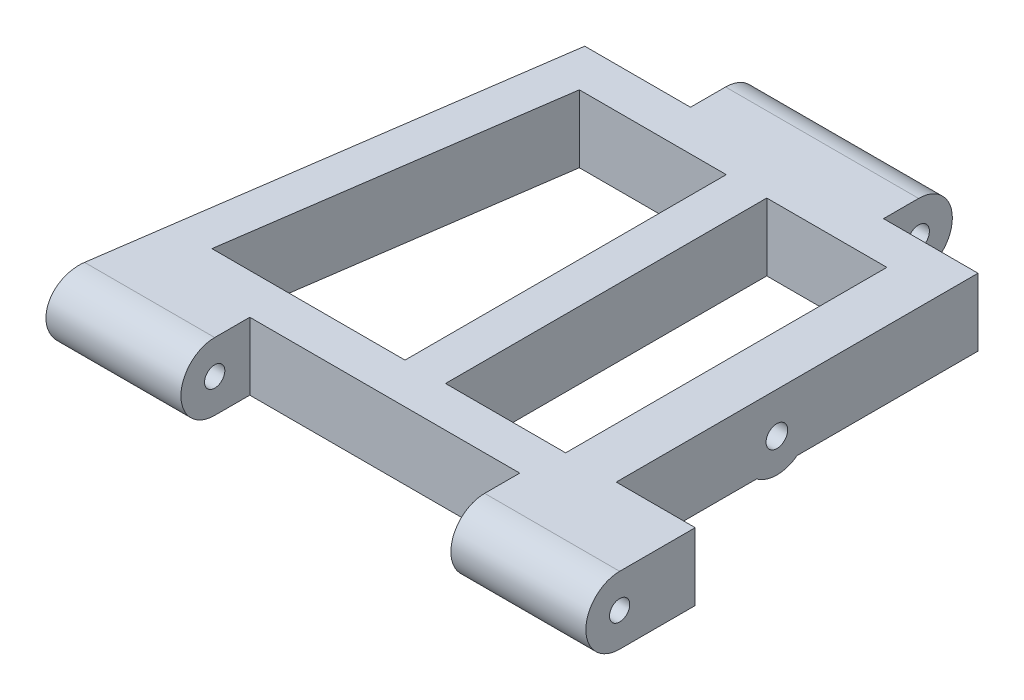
ISO-10303-21;
HEADER;
FILE_DESCRIPTION(('STEP AP214'),'2;1');
FILE_NAME('part.step','',(''),(''),'','','');
FILE_SCHEMA(('AUTOMOTIVE_DESIGN { 1 0 10303 214 1 1 1 1 }'));
ENDSEC;
DATA;
#1=APPLICATION_CONTEXT('core data for automotive mechanical design processes');
#2=APPLICATION_PROTOCOL_DEFINITION('international standard','automotive_design',2000,#1);
#3=PRODUCT_CONTEXT('',#1,'mechanical');
#4=PRODUCT('Part','Part','',(#3));
#5=PRODUCT_RELATED_PRODUCT_CATEGORY('part','',(#4));
#6=PRODUCT_DEFINITION_FORMATION('','',#4);
#7=PRODUCT_DEFINITION_CONTEXT('part definition',#1,'design');
#8=PRODUCT_DEFINITION('design','',#6,#7);
#9=PRODUCT_DEFINITION_SHAPE('','',#8);
#10=(LENGTH_UNIT() NAMED_UNIT(*) SI_UNIT(.MILLI.,.METRE.));
#11=(NAMED_UNIT(*) PLANE_ANGLE_UNIT() SI_UNIT($,.RADIAN.));
#12=(NAMED_UNIT(*) SI_UNIT($,.STERADIAN.) SOLID_ANGLE_UNIT());
#13=UNCERTAINTY_MEASURE_WITH_UNIT(LENGTH_MEASURE(1.E-05),#10,'distance_accuracy_value','');
#14=(GEOMETRIC_REPRESENTATION_CONTEXT(3) GLOBAL_UNCERTAINTY_ASSIGNED_CONTEXT((#13)) GLOBAL_UNIT_ASSIGNED_CONTEXT((#10,
#11,#12)) REPRESENTATION_CONTEXT('',''));
#15=CARTESIAN_POINT('',(0.,0.,0.));
#16=DIRECTION('',(0.,0.,1.));
#17=DIRECTION('',(1.,0.,0.));
#18=AXIS2_PLACEMENT_3D('',#15,#16,#17);
#19=CARTESIAN_POINT('',(-140.419266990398,10.,-20.1852696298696));
#20=DIRECTION('',(0.98982538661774,0.,0.1422873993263));
#21=DIRECTION('',(0.1422873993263,0.,-0.98982538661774));
#22=AXIS2_PLACEMENT_3D('',#19,#20,#21);
#23=PLANE('',#22);
#24=CARTESIAN_POINT('',(-138.818771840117,5.,-31.3191489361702));
#25=DIRECTION('',(0.98982538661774,0.,0.1422873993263));
#26=DIRECTION('',(-0.1422873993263,0.,0.98982538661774));
#27=AXIS2_PLACEMENT_3D('',#24,#25,#26);
#28=ELLIPSE('',#27,1.51541880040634,1.5);
#29=CARTESIAN_POINT('',(-139.034396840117,5.,-29.8191489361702));
#30=VERTEX_POINT('',#29);
#31=EDGE_CURVE('E372',#30,#30,#28,.T.);
#32=ORIENTED_EDGE('',*,*,#31,.T.);
#33=EDGE_LOOP('',(#32));
#34=FACE_BOUND('',#33,.T.);
#35=DIRECTION('',(-0.1422873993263,0.,0.98982538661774));
#36=VECTOR('',#35,1.);
#37=CARTESIAN_POINT('',(-140.419266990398,0.,-20.1852696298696));
#38=LINE('',#37,#36);
#39=CARTESIAN_POINT('',(-129.503771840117,0.,-96.1191489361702));
#40=VERTEX_POINT('',#39);
#41=CARTESIAN_POINT('',(-138.818771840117,0.,-31.3191489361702));
#42=VERTEX_POINT('',#41);
#43=EDGE_CURVE('E467',#40,#42,#38,.T.);
#44=ORIENTED_EDGE('',*,*,#43,.T.);
#45=CARTESIAN_POINT('',(-138.818771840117,5.,-31.3191489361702));
#46=DIRECTION('',(0.98982538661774,0.,0.1422873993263));
#47=DIRECTION('',(-0.1422873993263,0.,0.98982538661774));
#48=AXIS2_PLACEMENT_3D('',#45,#46,#47);
#49=ELLIPSE('',#48,5.05139600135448,5.);
#50=CARTESIAN_POINT('',(-138.818771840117,10.,-31.3191489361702));
#51=VERTEX_POINT('',#50);
#52=EDGE_CURVE('E379',#51,#42,#49,.T.);
#53=ORIENTED_EDGE('',*,*,#52,.F.);
#54=DIRECTION('',(-0.1422873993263,0.,0.98982538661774));
#55=VECTOR('',#54,1.);
#56=CARTESIAN_POINT('',(-140.419266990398,10.,-20.1852696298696));
#57=LINE('',#56,#55);
#58=CARTESIAN_POINT('',(-129.503771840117,10.,-96.1191489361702));
#59=VERTEX_POINT('',#58);
#60=EDGE_CURVE('E419',#59,#51,#57,.T.);
#61=ORIENTED_EDGE('',*,*,#60,.F.);
#62=DIRECTION('',(0.,-1.,0.));
#63=VECTOR('',#62,1.);
#64=CARTESIAN_POINT('',(-129.503771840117,10.,-96.1191489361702));
#65=LINE('',#64,#63);
#66=EDGE_CURVE('E510',#59,#40,#65,.T.);
#67=ORIENTED_EDGE('',*,*,#66,.T.);
#68=EDGE_LOOP('',(#44,#53,#61,#67));
#69=FACE_BOUND('',#68,.T.);
#70=ADVANCED_FACE('F162',(#34,#69),#23,.F.);
#71=CARTESIAN_POINT('',(-119.537521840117,10.,3.25277718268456E-13));
#72=DIRECTION('',(1.,0.,0.));
#73=DIRECTION('',(0.,0.,-1.));
#74=AXIS2_PLACEMENT_3D('',#71,#72,#73);
#75=PLANE('',#74);
#76=CARTESIAN_POINT('',(-119.537521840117,5.,-31.3191489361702));
#77=DIRECTION('',(1.,0.,0.));
#78=DIRECTION('',(0.,0.,-1.));
#79=AXIS2_PLACEMENT_3D('',#76,#77,#78);
#80=CIRCLE('',#79,1.5);
#81=CARTESIAN_POINT('',(-119.537521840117,5.,-32.8191489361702));
#82=VERTEX_POINT('',#81);
#83=EDGE_CURVE('E369',#82,#82,#80,.T.);
#84=ORIENTED_EDGE('',*,*,#83,.F.);
#85=EDGE_LOOP('',(#84));
#86=FACE_BOUND('',#85,.T.);
#87=CARTESIAN_POINT('',(-119.537521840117,5.,-31.3191489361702));
#88=DIRECTION('',(1.,0.,0.));
#89=DIRECTION('',(0.,0.,-1.));
#90=AXIS2_PLACEMENT_3D('',#87,#88,#89);
#91=CIRCLE('',#90,5.);
#92=CARTESIAN_POINT('',(-119.537521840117,10.,-31.3191489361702));
#93=VERTEX_POINT('',#92);
#94=CARTESIAN_POINT('',(-119.537521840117,0.,-31.3191489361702));
#95=VERTEX_POINT('',#94);
#96=EDGE_CURVE('E377',#93,#95,#91,.T.);
#97=ORIENTED_EDGE('',*,*,#96,.T.);
#98=DIRECTION('',(0.,0.,1.));
#99=VECTOR('',#98,1.);
#100=CARTESIAN_POINT('',(-119.537521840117,0.,3.25277718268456E-13));
#101=LINE('',#100,#99);
#102=CARTESIAN_POINT('',(-119.537521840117,0.,-36.5191489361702));
#103=VERTEX_POINT('',#102);
#104=EDGE_CURVE('E470',#103,#95,#101,.T.);
#105=ORIENTED_EDGE('',*,*,#104,.F.);
#106=DIRECTION('',(0.,-1.,0.));
#107=VECTOR('',#106,1.);
#108=CARTESIAN_POINT('',(-119.537521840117,10.,-36.5191489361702));
#109=LINE('',#108,#107);
#110=CARTESIAN_POINT('',(-119.537521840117,10.,-36.5191489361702));
#111=VERTEX_POINT('',#110);
#112=EDGE_CURVE('E508',#111,#103,#109,.T.);
#113=ORIENTED_EDGE('',*,*,#112,.F.);
#114=DIRECTION('',(0.,0.,1.));
#115=VECTOR('',#114,1.);
#116=CARTESIAN_POINT('',(-119.537521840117,10.,3.25277718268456E-13));
#117=LINE('',#116,#115);
#118=EDGE_CURVE('E422',#111,#93,#117,.T.);
#119=ORIENTED_EDGE('',*,*,#118,.T.);
#120=EDGE_LOOP('',(#97,#105,#113,#119));
#121=FACE_BOUND('',#120,.T.);
#122=ADVANCED_FACE('F590',(#86,#121),#75,.T.);
#123=CARTESIAN_POINT('',(-79.5375218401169,10.,0.));
#124=DIRECTION('',(1.,0.,0.));
#125=DIRECTION('',(0.,0.,-1.));
#126=AXIS2_PLACEMENT_3D('',#123,#124,#125);
#127=PLANE('',#126);
#128=CARTESIAN_POINT('',(-79.5375218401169,5.,-31.3191489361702));
#129=DIRECTION('',(1.,0.,0.));
#130=DIRECTION('',(0.,0.,-1.));
#131=AXIS2_PLACEMENT_3D('',#128,#129,#130);
#132=CIRCLE('',#131,1.5);
#133=CARTESIAN_POINT('',(-79.5375218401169,5.,-32.8191489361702));
#134=VERTEX_POINT('',#133);
#135=EDGE_CURVE('E366',#134,#134,#132,.T.);
#136=ORIENTED_EDGE('',*,*,#135,.T.);
#137=EDGE_LOOP('',(#136));
#138=FACE_BOUND('',#137,.T.);
#139=DIRECTION('',(0.,0.,1.));
#140=VECTOR('',#139,1.);
#141=CARTESIAN_POINT('',(-79.5375218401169,0.,0.));
#142=LINE('',#141,#140);
#143=CARTESIAN_POINT('',(-79.5375218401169,0.,-36.5191489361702));
#144=VERTEX_POINT('',#143);
#145=CARTESIAN_POINT('',(-79.5375218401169,0.,-31.3191489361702));
#146=VERTEX_POINT('',#145);
#147=EDGE_CURVE('E476',#144,#146,#142,.T.);
#148=ORIENTED_EDGE('',*,*,#147,.T.);
#149=CARTESIAN_POINT('',(-79.5375218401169,5.,-31.3191489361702));
#150=DIRECTION('',(1.,0.,0.));
#151=DIRECTION('',(0.,0.,-1.));
#152=AXIS2_PLACEMENT_3D('',#149,#150,#151);
#153=CIRCLE('',#152,5.);
#154=CARTESIAN_POINT('',(-79.5375218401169,10.,-31.3191489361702));
#155=VERTEX_POINT('',#154);
#156=EDGE_CURVE('E375',#155,#146,#153,.T.);
#157=ORIENTED_EDGE('',*,*,#156,.F.);
#158=DIRECTION('',(0.,0.,1.));
#159=VECTOR('',#158,1.);
#160=CARTESIAN_POINT('',(-79.5375218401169,10.,0.));
#161=LINE('',#160,#159);
#162=CARTESIAN_POINT('',(-79.5375218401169,10.,-36.5191489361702));
#163=VERTEX_POINT('',#162);
#164=EDGE_CURVE('E428',#163,#155,#161,.T.);
#165=ORIENTED_EDGE('',*,*,#164,.F.);
#166=DIRECTION('',(0.,-1.,0.));
#167=VECTOR('',#166,1.);
#168=CARTESIAN_POINT('',(-79.5375218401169,10.,-36.5191489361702));
#169=LINE('',#168,#167);
#170=EDGE_CURVE('E505',#163,#144,#169,.T.);
#171=ORIENTED_EDGE('',*,*,#170,.T.);
#172=EDGE_LOOP('',(#148,#157,#165,#171));
#173=FACE_BOUND('',#172,.T.);
#174=ADVANCED_FACE('F596',(#138,#173),#127,.F.);
#175=CARTESIAN_POINT('',(-59.5375218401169,10.,0.));
#176=DIRECTION('',(1.,0.,0.));
#177=DIRECTION('',(0.,0.,-1.));
#178=AXIS2_PLACEMENT_3D('',#175,#176,#177);
#179=PLANE('',#178);
#180=CARTESIAN_POINT('',(-59.5375218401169,5.,-31.3191489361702));
#181=DIRECTION('',(-1.,0.,0.));
#182=DIRECTION('',(0.,0.,1.));
#183=AXIS2_PLACEMENT_3D('',#180,#181,#182);
#184=CIRCLE('',#183,1.5);
#185=CARTESIAN_POINT('',(-59.5375218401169,5.,-29.8191489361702));
#186=VERTEX_POINT('',#185);
#187=EDGE_CURVE('E363',#186,#186,#184,.T.);
#188=ORIENTED_EDGE('',*,*,#187,.T.);
#189=EDGE_LOOP('',(#188));
#190=FACE_BOUND('',#189,.T.);
#191=CARTESIAN_POINT('',(-59.5375218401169,5.,-31.3191489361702));
#192=DIRECTION('',(-1.,0.,0.));
#193=DIRECTION('',(0.,0.,1.));
#194=AXIS2_PLACEMENT_3D('',#191,#192,#193);
#195=CIRCLE('',#194,5.);
#196=CARTESIAN_POINT('',(-59.5375218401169,0.,-31.3191489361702));
#197=VERTEX_POINT('',#196);
#198=CARTESIAN_POINT('',(-59.5375218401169,10.,-31.3191489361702));
#199=VERTEX_POINT('',#198);
#200=EDGE_CURVE('E357',#197,#199,#195,.T.);
#201=ORIENTED_EDGE('',*,*,#200,.F.);
#202=DIRECTION('',(0.,0.,1.));
#203=VECTOR('',#202,1.);
#204=CARTESIAN_POINT('',(-59.5375218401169,0.,0.));
#205=LINE('',#204,#203);
#206=CARTESIAN_POINT('',(-59.5375218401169,0.,-42.5191489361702));
#207=VERTEX_POINT('',#206);
#208=EDGE_CURVE('E479',#207,#197,#205,.T.);
#209=ORIENTED_EDGE('',*,*,#208,.F.);
#210=DIRECTION('',(0.,-1.,0.));
#211=VECTOR('',#210,1.);
#212=CARTESIAN_POINT('',(-59.5375218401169,10.,-42.5191489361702));
#213=LINE('',#212,#211);
#214=CARTESIAN_POINT('',(-59.5375218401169,10.,-42.5191489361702));
#215=VERTEX_POINT('',#214);
#216=EDGE_CURVE('E503',#215,#207,#213,.T.);
#217=ORIENTED_EDGE('',*,*,#216,.F.);
#218=DIRECTION('',(0.,0.,1.));
#219=VECTOR('',#218,1.);
#220=CARTESIAN_POINT('',(-59.5375218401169,10.,0.));
#221=LINE('',#220,#219);
#222=EDGE_CURVE('E431',#215,#199,#221,.T.);
#223=ORIENTED_EDGE('',*,*,#222,.T.);
#224=EDGE_LOOP('',(#201,#209,#217,#223));
#225=FACE_BOUND('',#224,.T.);
#226=ADVANCED_FACE('F604',(#190,#225),#179,.T.);
#227=CARTESIAN_POINT('',(-85.2375218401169,10.,0.));
#228=DIRECTION('',(1.,0.,0.));
#229=DIRECTION('',(0.,0.,-1.));
#230=AXIS2_PLACEMENT_3D('',#227,#228,#229);
#231=PLANE('',#230);
#232=CARTESIAN_POINT('',(-85.2375218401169,5.,-101.31914893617));
#233=DIRECTION('',(1.,0.,0.));
#234=DIRECTION('',(0.,0.,-1.));
#235=AXIS2_PLACEMENT_3D('',#232,#233,#234);
#236=CIRCLE('',#235,1.60000000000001);
#237=CARTESIAN_POINT('',(-85.2375218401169,5.,-102.91914893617));
#238=VERTEX_POINT('',#237);
#239=EDGE_CURVE('E394',#238,#238,#236,.F.);
#240=ORIENTED_EDGE('',*,*,#239,.T.);
#241=EDGE_LOOP('',(#240));
#242=FACE_BOUND('',#241,.T.);
#243=DIRECTION('',(0.,0.,1.));
#244=VECTOR('',#243,1.);
#245=CARTESIAN_POINT('',(-85.2375218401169,0.,0.));
#246=LINE('',#245,#244);
#247=CARTESIAN_POINT('',(-85.2375218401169,0.,-101.31914893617));
#248=VERTEX_POINT('',#247);
#249=CARTESIAN_POINT('',(-85.2375218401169,0.,-96.1191489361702));
#250=VERTEX_POINT('',#249);
#251=EDGE_CURVE('E460',#248,#250,#246,.T.);
#252=ORIENTED_EDGE('',*,*,#251,.F.);
#253=CARTESIAN_POINT('',(-85.2375218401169,5.,-101.31914893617));
#254=DIRECTION('',(1.,0.,0.));
#255=DIRECTION('',(0.,0.,-1.));
#256=AXIS2_PLACEMENT_3D('',#253,#254,#255);
#257=CIRCLE('',#256,5.);
#258=CARTESIAN_POINT('',(-85.2375218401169,10.,-101.31914893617));
#259=VERTEX_POINT('',#258);
#260=EDGE_CURVE('E384',#259,#248,#257,.F.);
#261=ORIENTED_EDGE('',*,*,#260,.F.);
#262=DIRECTION('',(0.,0.,1.));
#263=VECTOR('',#262,1.);
#264=CARTESIAN_POINT('',(-85.2375218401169,10.,0.));
#265=LINE('',#264,#263);
#266=CARTESIAN_POINT('',(-85.2375218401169,10.,-96.1191489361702));
#267=VERTEX_POINT('',#266);
#268=EDGE_CURVE('E412',#259,#267,#265,.T.);
#269=ORIENTED_EDGE('',*,*,#268,.T.);
#270=DIRECTION('',(0.,-1.,0.));
#271=VECTOR('',#270,1.);
#272=CARTESIAN_POINT('',(-85.2375218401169,10.,-96.1191489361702));
#273=LINE('',#272,#271);
#274=EDGE_CURVE('E496',#267,#250,#273,.T.);
#275=ORIENTED_EDGE('',*,*,#274,.T.);
#276=EDGE_LOOP('',(#252,#261,#269,#275));
#277=FACE_BOUND('',#276,.T.);
#278=ADVANCED_FACE('F566',(#242,#277),#231,.T.);
#279=CARTESIAN_POINT('',(-113.837521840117,10.,0.));
#280=DIRECTION('',(1.,0.,0.));
#281=DIRECTION('',(0.,0.,-1.));
#282=AXIS2_PLACEMENT_3D('',#279,#280,#281);
#283=PLANE('',#282);
#284=CARTESIAN_POINT('',(-113.837521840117,5.,-101.31914893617));
#285=DIRECTION('',(-1.,0.,0.));
#286=DIRECTION('',(0.,0.,1.));
#287=AXIS2_PLACEMENT_3D('',#284,#285,#286);
#288=CIRCLE('',#287,1.60000000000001);
#289=CARTESIAN_POINT('',(-113.837521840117,5.,-99.7191489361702));
#290=VERTEX_POINT('',#289);
#291=EDGE_CURVE('E387',#290,#290,#288,.T.);
#292=ORIENTED_EDGE('',*,*,#291,.F.);
#293=EDGE_LOOP('',(#292));
#294=FACE_BOUND('',#293,.T.);
#295=CARTESIAN_POINT('',(-113.837521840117,5.,-101.31914893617));
#296=DIRECTION('',(-1.,0.,0.));
#297=DIRECTION('',(0.,0.,1.));
#298=AXIS2_PLACEMENT_3D('',#295,#296,#297);
#299=CIRCLE('',#298,5.);
#300=CARTESIAN_POINT('',(-113.837521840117,10.,-101.31914893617));
#301=VERTEX_POINT('',#300);
#302=CARTESIAN_POINT('',(-113.837521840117,0.,-101.31914893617));
#303=VERTEX_POINT('',#302);
#304=EDGE_CURVE('E385',#301,#303,#299,.T.);
#305=ORIENTED_EDGE('',*,*,#304,.T.);
#306=DIRECTION('',(0.,0.,1.));
#307=VECTOR('',#306,1.);
#308=CARTESIAN_POINT('',(-113.837521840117,0.,0.));
#309=LINE('',#308,#307);
#310=CARTESIAN_POINT('',(-113.837521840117,0.,-96.1191489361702));
#311=VERTEX_POINT('',#310);
#312=EDGE_CURVE('E462',#303,#311,#309,.T.);
#313=ORIENTED_EDGE('',*,*,#312,.T.);
#314=DIRECTION('',(0.,-1.,0.));
#315=VECTOR('',#314,1.);
#316=CARTESIAN_POINT('',(-113.837521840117,10.,-96.1191489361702));
#317=LINE('',#316,#315);
#318=CARTESIAN_POINT('',(-113.837521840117,10.,-96.1191489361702));
#319=VERTEX_POINT('',#318);
#320=EDGE_CURVE('E512',#319,#311,#317,.T.);
#321=ORIENTED_EDGE('',*,*,#320,.F.);
#322=DIRECTION('',(0.,0.,1.));
#323=VECTOR('',#322,1.);
#324=CARTESIAN_POINT('',(-113.837521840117,10.,0.));
#325=LINE('',#324,#323);
#326=EDGE_CURVE('E414',#301,#319,#325,.T.);
#327=ORIENTED_EDGE('',*,*,#326,.F.);
#328=EDGE_LOOP('',(#305,#313,#321,#327));
#329=FACE_BOUND('',#328,.T.);
#330=ADVANCED_FACE('F559',(#294,#329),#283,.F.);
#331=CARTESIAN_POINT('',(0.,0.,0.));
#332=DIRECTION('',(0.,1.,0.));
#333=DIRECTION('',(0.,0.,1.));
#334=AXIS2_PLACEMENT_3D('',#331,#332,#333);
#335=PLANE('',#334);
#336=DIRECTION('',(0.,0.,1.));
#337=VECTOR('',#336,1.);
#338=CARTESIAN_POINT('',(-102.537521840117,0.,0.));
#339=LINE('',#338,#337);
#340=CARTESIAN_POINT('',(-102.537521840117,0.,-90.1191489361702));
#341=VERTEX_POINT('',#340);
#342=CARTESIAN_POINT('',(-102.537521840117,0.,-42.5191489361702));
#343=VERTEX_POINT('',#342);
#344=EDGE_CURVE('E482',#341,#343,#339,.T.);
#345=ORIENTED_EDGE('',*,*,#344,.F.);
#346=DIRECTION('',(1.,0.,0.));
#347=VECTOR('',#346,1.);
#348=CARTESIAN_POINT('',(0.,0.,-90.1191489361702));
#349=LINE('',#348,#347);
#350=CARTESIAN_POINT('',(-124.304596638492,0.,-90.1191489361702));
#351=VERTEX_POINT('',#350);
#352=EDGE_CURVE('E401',#351,#341,#349,.T.);
#353=ORIENTED_EDGE('',*,*,#352,.F.);
#354=DIRECTION('',(-0.1422873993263,0.,0.98982538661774));
#355=VECTOR('',#354,1.);
#356=CARTESIAN_POINT('',(-134.480314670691,0.,-19.3315452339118));
#357=LINE('',#356,#355);
#358=CARTESIAN_POINT('',(-131.147096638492,0.,-42.5191489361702));
#359=VERTEX_POINT('',#358);
#360=EDGE_CURVE('E488',#351,#359,#357,.T.);
#361=ORIENTED_EDGE('',*,*,#360,.T.);
#362=DIRECTION('',(-1.,0.,0.));
#363=VECTOR('',#362,1.);
#364=CARTESIAN_POINT('',(0.,0.,-42.5191489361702));
#365=LINE('',#364,#363);
#366=EDGE_CURVE('E485',#343,#359,#365,.T.);
#367=ORIENTED_EDGE('',*,*,#366,.F.);
#368=EDGE_LOOP('',(#345,#353,#361,#367));
#369=FACE_BOUND('',#368,.T.);
#370=DIRECTION('',(0.,0.,1.));
#371=VECTOR('',#370,1.);
#372=CARTESIAN_POINT('',(-71.2375218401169,0.,0.));
#373=LINE('',#372,#371);
#374=CARTESIAN_POINT('',(-71.2375218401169,0.,-96.1191489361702));
#375=VERTEX_POINT('',#374);
#376=CARTESIAN_POINT('',(-71.2375218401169,0.,-69.3191489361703));
#377=VERTEX_POINT('',#376);
#378=EDGE_CURVE('E336',#375,#377,#373,.T.);
#379=ORIENTED_EDGE('',*,*,#378,.T.);
#380=DIRECTION('',(-1.,0.,0.));
#381=VECTOR('',#380,1.);
#382=CARTESIAN_POINT('',(-65.1547593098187,0.,-69.3191489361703));
#383=LINE('',#382,#381);
#384=CARTESIAN_POINT('',(-78.7375218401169,0.,-69.3191489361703));
#385=VERTEX_POINT('',#384);
#386=EDGE_CURVE('E186',#377,#385,#383,.T.);
#387=ORIENTED_EDGE('',*,*,#386,.T.);
#388=DIRECTION('',(0.,0.,1.));
#389=VECTOR('',#388,1.);
#390=CARTESIAN_POINT('',(-78.7375218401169,0.,0.));
#391=LINE('',#390,#389);
#392=CARTESIAN_POINT('',(-78.7375218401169,0.,-90.1191489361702));
#393=VERTEX_POINT('',#392);
#394=EDGE_CURVE('E447',#393,#385,#391,.T.);
#395=ORIENTED_EDGE('',*,*,#394,.F.);
#396=DIRECTION('',(1.,0.,0.));
#397=VECTOR('',#396,1.);
#398=CARTESIAN_POINT('',(0.,0.,-90.1191489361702));
#399=LINE('',#398,#397);
#400=CARTESIAN_POINT('',(-96.5375218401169,0.,-90.1191489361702));
#401=VERTEX_POINT('',#400);
#402=EDGE_CURVE('E455',#401,#393,#399,.T.);
#403=ORIENTED_EDGE('',*,*,#402,.F.);
#404=DIRECTION('',(0.,0.,1.));
#405=VECTOR('',#404,1.);
#406=CARTESIAN_POINT('',(-96.5375218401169,0.,0.));
#407=LINE('',#406,#405);
#408=CARTESIAN_POINT('',(-96.5375218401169,0.,-42.5191489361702));
#409=VERTEX_POINT('',#408);
#410=EDGE_CURVE('E452',#401,#409,#407,.T.);
#411=ORIENTED_EDGE('',*,*,#410,.T.);
#412=DIRECTION('',(-1.,0.,0.));
#413=VECTOR('',#412,1.);
#414=CARTESIAN_POINT('',(0.,0.,-42.5191489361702));
#415=LINE('',#414,#413);
#416=CARTESIAN_POINT('',(-78.7375218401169,0.,-42.5191489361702));
#417=VERTEX_POINT('',#416);
#418=EDGE_CURVE('E449',#417,#409,#415,.T.);
#419=ORIENTED_EDGE('',*,*,#418,.F.);
#420=CARTESIAN_POINT('',(-78.7375218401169,0.,-63.3191489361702));
#421=VERTEX_POINT('',#420);
#422=EDGE_CURVE('E179',#421,#417,#391,.T.);
#423=ORIENTED_EDGE('',*,*,#422,.F.);
#424=DIRECTION('',(-1.,0.,0.));
#425=VECTOR('',#424,1.);
#426=CARTESIAN_POINT('',(-65.1547593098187,0.,-63.3191489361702));
#427=LINE('',#426,#425);
#428=CARTESIAN_POINT('',(-71.2375218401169,0.,-63.3191489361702));
#429=VERTEX_POINT('',#428);
#430=EDGE_CURVE('E339',#429,#421,#427,.T.);
#431=ORIENTED_EDGE('',*,*,#430,.F.);
#432=CARTESIAN_POINT('',(-71.2375218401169,0.,-42.5191489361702));
#433=VERTEX_POINT('',#432);
#434=EDGE_CURVE('E326',#429,#433,#373,.T.);
#435=ORIENTED_EDGE('',*,*,#434,.T.);
#436=EDGE_CURVE('E337',#207,#433,#415,.T.);
#437=ORIENTED_EDGE('',*,*,#436,.F.);
#438=ORIENTED_EDGE('',*,*,#208,.T.);
#439=DIRECTION('',(-1.,0.,0.));
#440=VECTOR('',#439,1.);
#441=CARTESIAN_POINT('',(-59.5375218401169,0.,-31.3191489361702));
#442=LINE('',#441,#440);
#443=EDGE_CURVE('E354',#197,#146,#442,.T.);
#444=ORIENTED_EDGE('',*,*,#443,.T.);
#445=ORIENTED_EDGE('',*,*,#147,.F.);
#446=DIRECTION('',(1.,0.,0.));
#447=VECTOR('',#446,1.);
#448=CARTESIAN_POINT('',(0.,0.,-36.5191489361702));
#449=LINE('',#448,#447);
#450=EDGE_CURVE('E473',#103,#144,#449,.T.);
#451=ORIENTED_EDGE('',*,*,#450,.F.);
#452=ORIENTED_EDGE('',*,*,#104,.T.);
#453=EDGE_CURVE('E358',#95,#42,#442,.T.);
#454=ORIENTED_EDGE('',*,*,#453,.T.);
#455=ORIENTED_EDGE('',*,*,#43,.F.);
#456=DIRECTION('',(1.,0.,0.));
#457=VECTOR('',#456,1.);
#458=CARTESIAN_POINT('',(0.,0.,-96.1191489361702));
#459=LINE('',#458,#457);
#460=EDGE_CURVE('E464',#40,#311,#459,.T.);
#461=ORIENTED_EDGE('',*,*,#460,.T.);
#462=ORIENTED_EDGE('',*,*,#312,.F.);
#463=DIRECTION('',(-1.,0.,0.));
#464=VECTOR('',#463,1.);
#465=CARTESIAN_POINT('',(-78.1664540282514,0.,-101.31914893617));
#466=LINE('',#465,#464);
#467=EDGE_CURVE('E381',#248,#303,#466,.T.);
#468=ORIENTED_EDGE('',*,*,#467,.F.);
#469=ORIENTED_EDGE('',*,*,#251,.T.);
#470=DIRECTION('',(1.,0.,0.));
#471=VECTOR('',#470,1.);
#472=CARTESIAN_POINT('',(0.,0.,-96.1191489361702));
#473=LINE('',#472,#471);
#474=EDGE_CURVE('E457',#250,#375,#473,.T.);
#475=ORIENTED_EDGE('',*,*,#474,.T.);
#476=EDGE_LOOP('',(#379,#387,#395,#403,#411,#419,#423,#431,#435,#437,#438,#444,#445,#451,#452,
#454,#455,#461,#462,#468,#469,#475));
#477=FACE_BOUND('',#476,.T.);
#478=ADVANCED_FACE('F340',(#369,#477),#335,.F.);
#479=CARTESIAN_POINT('',(0.,10.,0.));
#480=DIRECTION('',(0.,1.,0.));
#481=DIRECTION('',(0.,0.,1.));
#482=AXIS2_PLACEMENT_3D('',#479,#480,#481);
#483=PLANE('',#482);
#484=DIRECTION('',(-1.,0.,0.));
#485=VECTOR('',#484,1.);
#486=CARTESIAN_POINT('',(-59.5375218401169,10.,-31.3191489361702));
#487=LINE('',#486,#485);
#488=EDGE_CURVE('E361',#199,#155,#487,.T.);
#489=ORIENTED_EDGE('',*,*,#488,.F.);
#490=ORIENTED_EDGE('',*,*,#222,.F.);
#491=DIRECTION('',(-1.,0.,0.));
#492=VECTOR('',#491,1.);
#493=CARTESIAN_POINT('',(0.,10.,-42.5191489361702));
#494=LINE('',#493,#492);
#495=CARTESIAN_POINT('',(-71.2375218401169,10.,-42.5191489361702));
#496=VERTEX_POINT('',#495);
#497=EDGE_CURVE('E404',#215,#496,#494,.T.);
#498=ORIENTED_EDGE('',*,*,#497,.T.);
#499=DIRECTION('',(0.,0.,1.));
#500=VECTOR('',#499,1.);
#501=CARTESIAN_POINT('',(-71.2375218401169,10.,0.));
#502=LINE('',#501,#500);
#503=CARTESIAN_POINT('',(-71.2375218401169,10.,-96.1191489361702));
#504=VERTEX_POINT('',#503);
#505=EDGE_CURVE('E434',#504,#496,#502,.T.);
#506=ORIENTED_EDGE('',*,*,#505,.F.);
#507=DIRECTION('',(1.,0.,0.));
#508=VECTOR('',#507,1.);
#509=CARTESIAN_POINT('',(0.,10.,-96.1191489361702));
#510=LINE('',#509,#508);
#511=EDGE_CURVE('E409',#267,#504,#510,.T.);
#512=ORIENTED_EDGE('',*,*,#511,.F.);
#513=ORIENTED_EDGE('',*,*,#268,.F.);
#514=DIRECTION('',(-1.,0.,0.));
#515=VECTOR('',#514,1.);
#516=CARTESIAN_POINT('',(-78.1664540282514,10.,-101.31914893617));
#517=LINE('',#516,#515);
#518=EDGE_CURVE('E388',#259,#301,#517,.T.);
#519=ORIENTED_EDGE('',*,*,#518,.T.);
#520=ORIENTED_EDGE('',*,*,#326,.T.);
#521=DIRECTION('',(1.,0.,0.));
#522=VECTOR('',#521,1.);
#523=CARTESIAN_POINT('',(0.,10.,-96.1191489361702));
#524=LINE('',#523,#522);
#525=EDGE_CURVE('E416',#59,#319,#524,.T.);
#526=ORIENTED_EDGE('',*,*,#525,.F.);
#527=ORIENTED_EDGE('',*,*,#60,.T.);
#528=EDGE_CURVE('E360',#93,#51,#487,.T.);
#529=ORIENTED_EDGE('',*,*,#528,.F.);
#530=ORIENTED_EDGE('',*,*,#118,.F.);
#531=DIRECTION('',(1.,0.,0.));
#532=VECTOR('',#531,1.);
#533=CARTESIAN_POINT('',(0.,10.,-36.5191489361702));
#534=LINE('',#533,#532);
#535=EDGE_CURVE('E425',#111,#163,#534,.T.);
#536=ORIENTED_EDGE('',*,*,#535,.T.);
#537=ORIENTED_EDGE('',*,*,#164,.T.);
#538=EDGE_LOOP('',(#489,#490,#498,#506,#512,#513,#519,#520,#526,#527,#529,#530,#536,#537));
#539=FACE_BOUND('',#538,.T.);
#540=DIRECTION('',(0.,0.,1.));
#541=VECTOR('',#540,1.);
#542=CARTESIAN_POINT('',(-78.7375218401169,10.,0.));
#543=LINE('',#542,#541);
#544=CARTESIAN_POINT('',(-78.7375218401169,10.,-90.1191489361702));
#545=VERTEX_POINT('',#544);
#546=CARTESIAN_POINT('',(-78.7375218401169,10.,-42.5191489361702));
#547=VERTEX_POINT('',#546);
#548=EDGE_CURVE('E397',#545,#547,#543,.T.);
#549=ORIENTED_EDGE('',*,*,#548,.T.);
#550=CARTESIAN_POINT('',(-96.5375218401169,10.,-42.5191489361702));
#551=VERTEX_POINT('',#550);
#552=EDGE_CURVE('E400',#547,#551,#494,.T.);
#553=ORIENTED_EDGE('',*,*,#552,.T.);
#554=DIRECTION('',(0.,0.,1.));
#555=VECTOR('',#554,1.);
#556=CARTESIAN_POINT('',(-96.5375218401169,10.,0.));
#557=LINE('',#556,#555);
#558=CARTESIAN_POINT('',(-96.5375218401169,10.,-90.1191489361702));
#559=VERTEX_POINT('',#558);
#560=EDGE_CURVE('E403',#559,#551,#557,.T.);
#561=ORIENTED_EDGE('',*,*,#560,.F.);
#562=DIRECTION('',(1.,0.,0.));
#563=VECTOR('',#562,1.);
#564=CARTESIAN_POINT('',(0.,10.,-90.1191489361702));
#565=LINE('',#564,#563);
#566=EDGE_CURVE('E407',#559,#545,#565,.T.);
#567=ORIENTED_EDGE('',*,*,#566,.T.);
#568=EDGE_LOOP('',(#549,#553,#561,#567));
#569=FACE_BOUND('',#568,.T.);
#570=DIRECTION('',(0.,0.,1.));
#571=VECTOR('',#570,1.);
#572=CARTESIAN_POINT('',(-102.537521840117,10.,0.));
#573=LINE('',#572,#571);
#574=CARTESIAN_POINT('',(-102.537521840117,10.,-90.1191489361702));
#575=VERTEX_POINT('',#574);
#576=CARTESIAN_POINT('',(-102.537521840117,10.,-42.5191489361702));
#577=VERTEX_POINT('',#576);
#578=EDGE_CURVE('E436',#575,#577,#573,.T.);
#579=ORIENTED_EDGE('',*,*,#578,.T.);
#580=DIRECTION('',(-1.,0.,0.));
#581=VECTOR('',#580,1.);
#582=CARTESIAN_POINT('',(0.,10.,-42.5191489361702));
#583=LINE('',#582,#581);
#584=CARTESIAN_POINT('',(-131.147096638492,10.,-42.5191489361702));
#585=VERTEX_POINT('',#584);
#586=EDGE_CURVE('E439',#577,#585,#583,.T.);
#587=ORIENTED_EDGE('',*,*,#586,.T.);
#588=DIRECTION('',(-0.1422873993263,0.,0.98982538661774));
#589=VECTOR('',#588,1.);
#590=CARTESIAN_POINT('',(-134.480314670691,10.,-19.3315452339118));
#591=LINE('',#590,#589);
#592=CARTESIAN_POINT('',(-124.304596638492,10.,-90.1191489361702));
#593=VERTEX_POINT('',#592);
#594=EDGE_CURVE('E441',#593,#585,#591,.T.);
#595=ORIENTED_EDGE('',*,*,#594,.F.);
#596=DIRECTION('',(1.,0.,0.));
#597=VECTOR('',#596,1.);
#598=CARTESIAN_POINT('',(0.,10.,-90.1191489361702));
#599=LINE('',#598,#597);
#600=EDGE_CURVE('E444',#593,#575,#599,.T.);
#601=ORIENTED_EDGE('',*,*,#600,.T.);
#602=EDGE_LOOP('',(#579,#587,#595,#601));
#603=FACE_BOUND('',#602,.T.);
#604=ADVANCED_FACE('F536',(#539,#569,#603),#483,.T.);
#605=CARTESIAN_POINT('',(-102.537521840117,10.,0.));
#606=DIRECTION('',(1.,0.,0.));
#607=DIRECTION('',(0.,0.,-1.));
#608=AXIS2_PLACEMENT_3D('',#605,#606,#607);
#609=PLANE('',#608);
#610=ORIENTED_EDGE('',*,*,#344,.T.);
#611=DIRECTION('',(0.,-1.,0.));
#612=VECTOR('',#611,1.);
#613=CARTESIAN_POINT('',(-102.537521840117,10.,-42.5191489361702));
#614=LINE('',#613,#612);
#615=EDGE_CURVE('E12',#577,#343,#614,.T.);
#616=ORIENTED_EDGE('',*,*,#615,.F.);
#617=ORIENTED_EDGE('',*,*,#578,.F.);
#618=DIRECTION('',(0.,-1.,0.));
#619=VECTOR('',#618,1.);
#620=CARTESIAN_POINT('',(-102.537521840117,10.,-90.1191489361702));
#621=LINE('',#620,#619);
#622=EDGE_CURVE('E492',#575,#341,#621,.T.);
#623=ORIENTED_EDGE('',*,*,#622,.T.);
#624=EDGE_LOOP('',(#610,#616,#617,#623));
#625=FACE_BOUND('',#624,.T.);
#626=ADVANCED_FACE('F631',(#625),#609,.F.);
#627=CARTESIAN_POINT('',(0.,10.,-42.5191489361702));
#628=DIRECTION('',(0.,0.,1.));
#629=DIRECTION('',(1.,0.,0.));
#630=AXIS2_PLACEMENT_3D('',#627,#628,#629);
#631=PLANE('',#630);
#632=ORIENTED_EDGE('',*,*,#366,.T.);
#633=DIRECTION('',(0.,-1.,0.));
#634=VECTOR('',#633,1.);
#635=CARTESIAN_POINT('',(-131.147096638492,10.,-42.5191489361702));
#636=LINE('',#635,#634);
#637=EDGE_CURVE('E171',#585,#359,#636,.T.);
#638=ORIENTED_EDGE('',*,*,#637,.F.);
#639=ORIENTED_EDGE('',*,*,#586,.F.);
#640=ORIENTED_EDGE('',*,*,#615,.T.);
#641=EDGE_LOOP('',(#632,#638,#639,#640));
#642=FACE_BOUND('',#641,.T.);
#643=ADVANCED_FACE('F584',(#642),#631,.F.);
#644=CARTESIAN_POINT('',(-134.480314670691,10.,-19.3315452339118));
#645=DIRECTION('',(0.98982538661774,0.,0.1422873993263));
#646=DIRECTION('',(0.1422873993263,0.,-0.98982538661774));
#647=AXIS2_PLACEMENT_3D('',#644,#645,#646);
#648=PLANE('',#647);
#649=ORIENTED_EDGE('',*,*,#360,.F.);
#650=DIRECTION('',(0.,-1.,0.));
#651=VECTOR('',#650,1.);
#652=CARTESIAN_POINT('',(-124.304596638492,10.,-90.1191489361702));
#653=LINE('',#652,#651);
#654=EDGE_CURVE('E495',#593,#351,#653,.T.);
#655=ORIENTED_EDGE('',*,*,#654,.F.);
#656=ORIENTED_EDGE('',*,*,#594,.T.);
#657=ORIENTED_EDGE('',*,*,#637,.T.);
#658=EDGE_LOOP('',(#649,#655,#656,#657));
#659=FACE_BOUND('',#658,.T.);
#660=ADVANCED_FACE('F576',(#659),#648,.T.);
#661=CARTESIAN_POINT('',(0.,10.,-96.1191489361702));
#662=DIRECTION('',(0.,0.,-1.));
#663=DIRECTION('',(-1.,0.,0.));
#664=AXIS2_PLACEMENT_3D('',#661,#662,#663);
#665=PLANE('',#664);
#666=ORIENTED_EDGE('',*,*,#474,.F.);
#667=ORIENTED_EDGE('',*,*,#274,.F.);
#668=ORIENTED_EDGE('',*,*,#511,.T.);
#669=DIRECTION('',(0.,-1.,0.));
#670=VECTOR('',#669,1.);
#671=CARTESIAN_POINT('',(-71.2375218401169,10.,-96.1191489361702));
#672=LINE('',#671,#670);
#673=EDGE_CURVE('E499',#504,#375,#672,.T.);
#674=ORIENTED_EDGE('',*,*,#673,.T.);
#675=EDGE_LOOP('',(#666,#667,#668,#674));
#676=FACE_BOUND('',#675,.T.);
#677=ADVANCED_FACE('F574',(#676),#665,.T.);
#678=CARTESIAN_POINT('',(0.,10.,-96.1191489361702));
#679=DIRECTION('',(0.,0.,-1.));
#680=DIRECTION('',(-1.,0.,0.));
#681=AXIS2_PLACEMENT_3D('',#678,#679,#680);
#682=PLANE('',#681);
#683=ORIENTED_EDGE('',*,*,#460,.F.);
#684=ORIENTED_EDGE('',*,*,#66,.F.);
#685=ORIENTED_EDGE('',*,*,#525,.T.);
#686=ORIENTED_EDGE('',*,*,#320,.T.);
#687=EDGE_LOOP('',(#683,#684,#685,#686));
#688=FACE_BOUND('',#687,.T.);
#689=ADVANCED_FACE('F553',(#688),#682,.T.);
#690=CARTESIAN_POINT('',(0.,10.,-36.5191489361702));
#691=DIRECTION('',(0.,0.,-1.));
#692=DIRECTION('',(-1.,0.,0.));
#693=AXIS2_PLACEMENT_3D('',#690,#691,#692);
#694=PLANE('',#693);
#695=ORIENTED_EDGE('',*,*,#450,.T.);
#696=ORIENTED_EDGE('',*,*,#170,.F.);
#697=ORIENTED_EDGE('',*,*,#535,.F.);
#698=ORIENTED_EDGE('',*,*,#112,.T.);
#699=EDGE_LOOP('',(#695,#696,#697,#698));
#700=FACE_BOUND('',#699,.T.);
#701=ADVANCED_FACE('F582',(#700),#694,.F.);
#702=CARTESIAN_POINT('',(0.,10.,-42.5191489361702));
#703=DIRECTION('',(0.,0.,1.));
#704=DIRECTION('',(1.,0.,0.));
#705=AXIS2_PLACEMENT_3D('',#702,#703,#704);
#706=PLANE('',#705);
#707=ORIENTED_EDGE('',*,*,#436,.T.);
#708=DIRECTION('',(0.,-1.,0.));
#709=VECTOR('',#708,1.);
#710=CARTESIAN_POINT('',(-71.2375218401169,10.,-42.5191489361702));
#711=LINE('',#710,#709);
#712=EDGE_CURVE('E333',#496,#433,#711,.T.);
#713=ORIENTED_EDGE('',*,*,#712,.F.);
#714=ORIENTED_EDGE('',*,*,#497,.F.);
#715=ORIENTED_EDGE('',*,*,#216,.T.);
#716=EDGE_LOOP('',(#707,#713,#714,#715));
#717=FACE_BOUND('',#716,.T.);
#718=ADVANCED_FACE('F647',(#717),#706,.F.);
#719=CARTESIAN_POINT('',(-78.7375218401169,10.,0.));
#720=DIRECTION('',(1.,0.,0.));
#721=DIRECTION('',(0.,0.,-1.));
#722=AXIS2_PLACEMENT_3D('',#719,#720,#721);
#723=PLANE('',#722);
#724=CARTESIAN_POINT('',(-78.7375218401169,4.,-66.3191489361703));
#725=DIRECTION('',(-1.,0.,0.));
#726=DIRECTION('',(0.,0.,1.));
#727=AXIS2_PLACEMENT_3D('',#724,#725,#726);
#728=CIRCLE('',#727,1.60000000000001);
#729=CARTESIAN_POINT('',(-78.7375218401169,4.,-64.7191489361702));
#730=VERTEX_POINT('',#729);
#731=EDGE_CURVE('E348',#730,#730,#728,.T.);
#732=ORIENTED_EDGE('',*,*,#731,.F.);
#733=EDGE_LOOP('',(#732));
#734=FACE_BOUND('',#733,.T.);
#735=ORIENTED_EDGE('',*,*,#394,.T.);
#736=CARTESIAN_POINT('',(-78.7375218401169,4.,-66.3191489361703));
#737=DIRECTION('',(-1.,0.,0.));
#738=DIRECTION('',(0.,0.,1.));
#739=AXIS2_PLACEMENT_3D('',#736,#737,#738);
#740=CIRCLE('',#739,5.);
#741=EDGE_CURVE('E351',#385,#421,#740,.T.);
#742=ORIENTED_EDGE('',*,*,#741,.T.);
#743=ORIENTED_EDGE('',*,*,#422,.T.);
#744=DIRECTION('',(0.,-1.,0.));
#745=VECTOR('',#744,1.);
#746=CARTESIAN_POINT('',(-78.7375218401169,10.,-42.5191489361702));
#747=LINE('',#746,#745);
#748=EDGE_CURVE('E501',#547,#417,#747,.T.);
#749=ORIENTED_EDGE('',*,*,#748,.F.);
#750=ORIENTED_EDGE('',*,*,#548,.F.);
#751=DIRECTION('',(0.,-1.,0.));
#752=VECTOR('',#751,1.);
#753=CARTESIAN_POINT('',(-78.7375218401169,10.,-90.1191489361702));
#754=LINE('',#753,#752);
#755=EDGE_CURVE('E446',#545,#393,#754,.T.);
#756=ORIENTED_EDGE('',*,*,#755,.T.);
#757=EDGE_LOOP('',(#735,#742,#743,#749,#750,#756));
#758=FACE_BOUND('',#757,.T.);
#759=ADVANCED_FACE('F164',(#734,#758),#723,.F.);
#760=ORIENTED_EDGE('',*,*,#418,.T.);
#761=DIRECTION('',(0.,-1.,0.));
#762=VECTOR('',#761,1.);
#763=CARTESIAN_POINT('',(-96.5375218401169,10.,-42.5191489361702));
#764=LINE('',#763,#762);
#765=EDGE_CURVE('E521',#551,#409,#764,.T.);
#766=ORIENTED_EDGE('',*,*,#765,.F.);
#767=ORIENTED_EDGE('',*,*,#552,.F.);
#768=ORIENTED_EDGE('',*,*,#748,.T.);
#769=EDGE_LOOP('',(#760,#766,#767,#768));
#770=FACE_BOUND('',#769,.T.);
#771=ADVANCED_FACE('F525',(#770),#706,.F.);
#772=CARTESIAN_POINT('',(-96.5375218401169,10.,0.));
#773=DIRECTION('',(1.,0.,0.));
#774=DIRECTION('',(0.,0.,-1.));
#775=AXIS2_PLACEMENT_3D('',#772,#773,#774);
#776=PLANE('',#775);
#777=ORIENTED_EDGE('',*,*,#410,.F.);
#778=DIRECTION('',(0.,-1.,0.));
#779=VECTOR('',#778,1.);
#780=CARTESIAN_POINT('',(-96.5375218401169,10.,-90.1191489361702));
#781=LINE('',#780,#779);
#782=EDGE_CURVE('E519',#559,#401,#781,.T.);
#783=ORIENTED_EDGE('',*,*,#782,.F.);
#784=ORIENTED_EDGE('',*,*,#560,.T.);
#785=ORIENTED_EDGE('',*,*,#765,.T.);
#786=EDGE_LOOP('',(#777,#783,#784,#785));
#787=FACE_BOUND('',#786,.T.);
#788=ADVANCED_FACE('F532',(#787),#776,.T.);
#789=CARTESIAN_POINT('',(-71.2375218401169,10.,0.));
#790=DIRECTION('',(1.,0.,0.));
#791=DIRECTION('',(0.,0.,-1.));
#792=AXIS2_PLACEMENT_3D('',#789,#790,#791);
#793=PLANE('',#792);
#794=CARTESIAN_POINT('',(-71.2375218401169,4.,-66.3191489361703));
#795=DIRECTION('',(1.,0.,0.));
#796=DIRECTION('',(0.,0.,-1.));
#797=AXIS2_PLACEMENT_3D('',#794,#795,#796);
#798=CIRCLE('',#797,1.60000000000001);
#799=CARTESIAN_POINT('',(-71.2375218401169,4.,-67.9191489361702));
#800=VERTEX_POINT('',#799);
#801=EDGE_CURVE('E166',#800,#800,#798,.T.);
#802=ORIENTED_EDGE('',*,*,#801,.F.);
#803=EDGE_LOOP('',(#802));
#804=FACE_BOUND('',#803,.T.);
#805=ORIENTED_EDGE('',*,*,#378,.F.);
#806=ORIENTED_EDGE('',*,*,#673,.F.);
#807=ORIENTED_EDGE('',*,*,#505,.T.);
#808=ORIENTED_EDGE('',*,*,#712,.T.);
#809=ORIENTED_EDGE('',*,*,#434,.F.);
#810=CARTESIAN_POINT('',(-71.2375218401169,4.,-66.3191489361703));
#811=DIRECTION('',(1.,0.,0.));
#812=DIRECTION('',(0.,0.,-1.));
#813=AXIS2_PLACEMENT_3D('',#810,#811,#812);
#814=CIRCLE('',#813,5.);
#815=EDGE_CURVE('E330',#377,#429,#814,.F.);
#816=ORIENTED_EDGE('',*,*,#815,.F.);
#817=EDGE_LOOP('',(#805,#806,#807,#808,#809,#816));
#818=FACE_BOUND('',#817,.T.);
#819=ADVANCED_FACE('F328',(#804,#818),#793,.T.);
#820=CARTESIAN_POINT('',(0.,10.,-90.1191489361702));
#821=DIRECTION('',(0.,0.,-1.));
#822=DIRECTION('',(-1.,0.,0.));
#823=AXIS2_PLACEMENT_3D('',#820,#821,#822);
#824=PLANE('',#823);
#825=ORIENTED_EDGE('',*,*,#402,.T.);
#826=ORIENTED_EDGE('',*,*,#755,.F.);
#827=ORIENTED_EDGE('',*,*,#566,.F.);
#828=ORIENTED_EDGE('',*,*,#782,.T.);
#829=EDGE_LOOP('',(#825,#826,#827,#828));
#830=FACE_BOUND('',#829,.T.);
#831=ADVANCED_FACE('F540',(#830),#824,.F.);
#832=CARTESIAN_POINT('',(0.,10.,-90.1191489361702));
#833=DIRECTION('',(0.,0.,-1.));
#834=DIRECTION('',(-1.,0.,0.));
#835=AXIS2_PLACEMENT_3D('',#832,#833,#834);
#836=PLANE('',#835);
#837=ORIENTED_EDGE('',*,*,#352,.T.);
#838=ORIENTED_EDGE('',*,*,#622,.F.);
#839=ORIENTED_EDGE('',*,*,#600,.F.);
#840=ORIENTED_EDGE('',*,*,#654,.T.);
#841=EDGE_LOOP('',(#837,#838,#839,#840));
#842=FACE_BOUND('',#841,.T.);
#843=ADVANCED_FACE('F626',(#842),#836,.F.);
#844=CARTESIAN_POINT('',(-78.1664540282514,5.,-101.31914893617));
#845=DIRECTION('',(-1.,0.,0.));
#846=DIRECTION('',(0.,0.,1.));
#847=AXIS2_PLACEMENT_3D('',#844,#845,#846);
#848=CYLINDRICAL_SURFACE('',#847,5.);
#849=ORIENTED_EDGE('',*,*,#260,.T.);
#850=ORIENTED_EDGE('',*,*,#467,.T.);
#851=ORIENTED_EDGE('',*,*,#304,.F.);
#852=ORIENTED_EDGE('',*,*,#518,.F.);
#853=EDGE_LOOP('',(#849,#850,#851,#852));
#854=FACE_BOUND('',#853,.T.);
#855=ADVANCED_FACE('F562',(#854),#848,.T.);
#856=CARTESIAN_POINT('',(-78.1664540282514,5.,-101.31914893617));
#857=DIRECTION('',(-1.,0.,0.));
#858=DIRECTION('',(0.,0.,1.));
#859=AXIS2_PLACEMENT_3D('',#856,#857,#858);
#860=CYLINDRICAL_SURFACE('',#859,1.60000000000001);
#861=ORIENTED_EDGE('',*,*,#291,.T.);
#862=EDGE_LOOP('',(#861));
#863=FACE_BOUND('',#862,.T.);
#864=ORIENTED_EDGE('',*,*,#239,.F.);
#865=EDGE_LOOP('',(#864));
#866=FACE_BOUND('',#865,.T.);
#867=ADVANCED_FACE('F613',(#863,#866),#860,.F.);
#868=CARTESIAN_POINT('',(-59.5375218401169,5.,-31.3191489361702));
#869=DIRECTION('',(-1.,0.,0.));
#870=DIRECTION('',(0.,0.,1.));
#871=AXIS2_PLACEMENT_3D('',#868,#869,#870);
#872=CYLINDRICAL_SURFACE('',#871,1.5);
#873=ORIENTED_EDGE('',*,*,#187,.F.);
#874=EDGE_LOOP('',(#873));
#875=FACE_BOUND('',#874,.T.);
#876=ORIENTED_EDGE('',*,*,#135,.F.);
#877=EDGE_LOOP('',(#876));
#878=FACE_BOUND('',#877,.T.);
#879=ADVANCED_FACE('F615',(#875,#878),#872,.F.);
#880=CARTESIAN_POINT('',(-59.5375218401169,5.,-31.3191489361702));
#881=DIRECTION('',(-1.,0.,0.));
#882=DIRECTION('',(0.,0.,1.));
#883=AXIS2_PLACEMENT_3D('',#880,#881,#882);
#884=CYLINDRICAL_SURFACE('',#883,5.);
#885=ORIENTED_EDGE('',*,*,#156,.T.);
#886=ORIENTED_EDGE('',*,*,#443,.F.);
#887=ORIENTED_EDGE('',*,*,#200,.T.);
#888=ORIENTED_EDGE('',*,*,#488,.T.);
#889=EDGE_LOOP('',(#885,#886,#887,#888));
#890=FACE_BOUND('',#889,.T.);
#891=ADVANCED_FACE('F622',(#890),#884,.T.);
#892=ORIENTED_EDGE('',*,*,#83,.T.);
#893=EDGE_LOOP('',(#892));
#894=FACE_BOUND('',#893,.T.);
#895=ORIENTED_EDGE('',*,*,#31,.F.);
#896=EDGE_LOOP('',(#895));
#897=FACE_BOUND('',#896,.T.);
#898=ADVANCED_FACE('F625',(#894,#897),#872,.F.);
#899=ORIENTED_EDGE('',*,*,#52,.T.);
#900=ORIENTED_EDGE('',*,*,#453,.F.);
#901=ORIENTED_EDGE('',*,*,#96,.F.);
#902=ORIENTED_EDGE('',*,*,#528,.T.);
#903=EDGE_LOOP('',(#899,#900,#901,#902));
#904=FACE_BOUND('',#903,.T.);
#905=ADVANCED_FACE('F662',(#904),#884,.T.);
#906=CARTESIAN_POINT('',(-65.1547593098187,4.,-66.3191489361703));
#907=DIRECTION('',(-1.,0.,0.));
#908=DIRECTION('',(0.,0.,1.));
#909=AXIS2_PLACEMENT_3D('',#906,#907,#908);
#910=CYLINDRICAL_SURFACE('',#909,5.);
#911=ORIENTED_EDGE('',*,*,#386,.F.);
#912=ORIENTED_EDGE('',*,*,#815,.T.);
#913=ORIENTED_EDGE('',*,*,#430,.T.);
#914=ORIENTED_EDGE('',*,*,#741,.F.);
#915=EDGE_LOOP('',(#911,#912,#913,#914));
#916=FACE_BOUND('',#915,.T.);
#917=ADVANCED_FACE('F345',(#916),#910,.T.);
#918=CARTESIAN_POINT('',(-68.7375218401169,4.,-66.3191489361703));
#919=DIRECTION('',(-1.,0.,0.));
#920=DIRECTION('',(0.,0.,1.));
#921=AXIS2_PLACEMENT_3D('',#918,#919,#920);
#922=CYLINDRICAL_SURFACE('',#921,1.60000000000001);
#923=ORIENTED_EDGE('',*,*,#801,.T.);
#924=EDGE_LOOP('',(#923));
#925=FACE_BOUND('',#924,.T.);
#926=ORIENTED_EDGE('',*,*,#731,.T.);
#927=EDGE_LOOP('',(#926));
#928=FACE_BOUND('',#927,.T.);
#929=ADVANCED_FACE('F682',(#925,#928),#922,.F.);
#930=CLOSED_SHELL('',(#70,#122,#174,#226,#278,#330,#478,#604,#626,#643,#660,#677,#689,#701,#718,
#759,#771,#788,#819,#831,#843,#855,#867,#879,#891,#898,#905,#917,#929));
#931=MANIFOLD_SOLID_BREP('B2',#930);
#932=ADVANCED_BREP_SHAPE_REPRESENTATION('',(#18,#931),#14);
#933=SHAPE_DEFINITION_REPRESENTATION(#9,#932);
ENDSEC;
END-ISO-10303-21;
